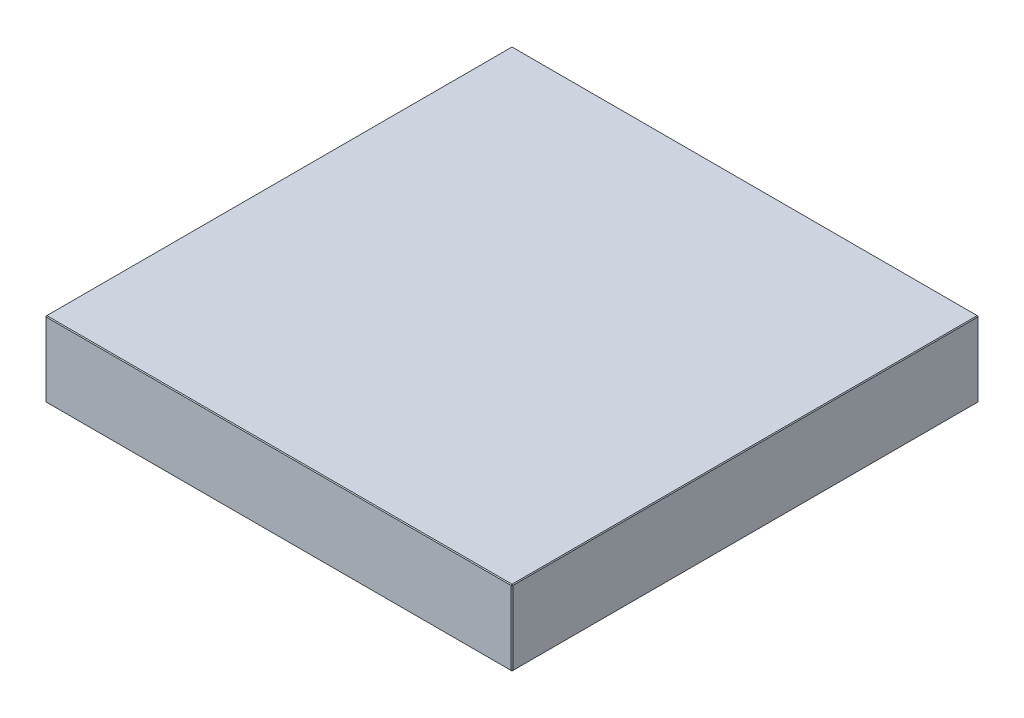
ISO-10303-21;
HEADER;
FILE_DESCRIPTION(('STEP AP214'),'2;1');
FILE_NAME('part.step','',(''),(''),'','','');
FILE_SCHEMA(('AUTOMOTIVE_DESIGN { 1 0 10303 214 1 1 1 1 }'));
ENDSEC;
DATA;
#1=APPLICATION_CONTEXT('core data for automotive mechanical design processes');
#2=APPLICATION_PROTOCOL_DEFINITION('international standard','automotive_design',2000,#1);
#3=PRODUCT_CONTEXT('',#1,'mechanical');
#4=PRODUCT('Part','Part','',(#3));
#5=PRODUCT_RELATED_PRODUCT_CATEGORY('part','',(#4));
#6=PRODUCT_DEFINITION_FORMATION('','',#4);
#7=PRODUCT_DEFINITION_CONTEXT('part definition',#1,'design');
#8=PRODUCT_DEFINITION('design','',#6,#7);
#9=PRODUCT_DEFINITION_SHAPE('','',#8);
#10=(LENGTH_UNIT() NAMED_UNIT(*) SI_UNIT(.MILLI.,.METRE.));
#11=(NAMED_UNIT(*) PLANE_ANGLE_UNIT() SI_UNIT($,.RADIAN.));
#12=(NAMED_UNIT(*) SI_UNIT($,.STERADIAN.) SOLID_ANGLE_UNIT());
#13=UNCERTAINTY_MEASURE_WITH_UNIT(LENGTH_MEASURE(1.E-05),#10,'distance_accuracy_value','');
#14=(GEOMETRIC_REPRESENTATION_CONTEXT(3) GLOBAL_UNCERTAINTY_ASSIGNED_CONTEXT((#13)) GLOBAL_UNIT_ASSIGNED_CONTEXT((#10,
#11,#12)) REPRESENTATION_CONTEXT('',''));
#15=CARTESIAN_POINT('',(0.,0.,0.));
#16=DIRECTION('',(0.,0.,1.));
#17=DIRECTION('',(1.,0.,0.));
#18=AXIS2_PLACEMENT_3D('',#15,#16,#17);
#19=CARTESIAN_POINT('',(-298.,96.,298.));
#20=DIRECTION('',(1.,0.,0.));
#21=DIRECTION('',(0.,0.,-1.));
#22=AXIS2_PLACEMENT_3D('',#19,#20,#21);
#23=PLANE('',#22);
#24=DIRECTION('',(0.,-1.,0.));
#25=VECTOR('',#24,1.);
#26=CARTESIAN_POINT('',(-298.,96.,-297.));
#27=LINE('',#26,#25);
#28=CARTESIAN_POINT('',(-298.,95.,-297.));
#29=VERTEX_POINT('',#28);
#30=CARTESIAN_POINT('',(-298.,1.,-297.));
#31=VERTEX_POINT('',#30);
#32=EDGE_CURVE('E115',#29,#31,#27,.T.);
#33=ORIENTED_EDGE('',*,*,#32,.T.);
#34=DIRECTION('',(0.,0.,1.));
#35=VECTOR('',#34,1.);
#36=CARTESIAN_POINT('',(-298.,1.,298.));
#37=LINE('',#36,#35);
#38=CARTESIAN_POINT('',(-298.,1.,297.));
#39=VERTEX_POINT('',#38);
#40=EDGE_CURVE('E111',#31,#39,#37,.T.);
#41=ORIENTED_EDGE('',*,*,#40,.T.);
#42=DIRECTION('',(0.,1.,0.));
#43=VECTOR('',#42,1.);
#44=CARTESIAN_POINT('',(-298.,96.,297.));
#45=LINE('',#44,#43);
#46=CARTESIAN_POINT('',(-298.,95.,297.));
#47=VERTEX_POINT('',#46);
#48=EDGE_CURVE('E104',#39,#47,#45,.T.);
#49=ORIENTED_EDGE('',*,*,#48,.T.);
#50=DIRECTION('',(0.,0.,-1.));
#51=VECTOR('',#50,1.);
#52=CARTESIAN_POINT('',(-298.,95.,-298.));
#53=LINE('',#52,#51);
#54=EDGE_CURVE('E108',#47,#29,#53,.T.);
#55=ORIENTED_EDGE('',*,*,#54,.T.);
#56=EDGE_LOOP('',(#33,#41,#49,#55));
#57=FACE_BOUND('',#56,.T.);
#58=ADVANCED_FACE('F16',(#57),#23,.F.);
#59=CARTESIAN_POINT('',(298.,96.,298.));
#60=DIRECTION('',(0.,0.,-1.));
#61=DIRECTION('',(-1.,0.,0.));
#62=AXIS2_PLACEMENT_3D('',#59,#60,#61);
#63=PLANE('',#62);
#64=DIRECTION('',(-1.,0.,0.));
#65=VECTOR('',#64,1.);
#66=CARTESIAN_POINT('',(-298.,95.,298.));
#67=LINE('',#66,#65);
#68=CARTESIAN_POINT('',(297.,95.,298.));
#69=VERTEX_POINT('',#68);
#70=CARTESIAN_POINT('',(-297.,95.,298.));
#71=VERTEX_POINT('',#70);
#72=EDGE_CURVE('E165',#69,#71,#67,.T.);
#73=ORIENTED_EDGE('',*,*,#72,.T.);
#74=DIRECTION('',(0.,-1.,0.));
#75=VECTOR('',#74,1.);
#76=CARTESIAN_POINT('',(-297.,96.,298.));
#77=LINE('',#76,#75);
#78=CARTESIAN_POINT('',(-297.,1.,298.));
#79=VERTEX_POINT('',#78);
#80=EDGE_CURVE('E123',#71,#79,#77,.T.);
#81=ORIENTED_EDGE('',*,*,#80,.T.);
#82=DIRECTION('',(1.,0.,0.));
#83=VECTOR('',#82,1.);
#84=CARTESIAN_POINT('',(298.,1.,298.));
#85=LINE('',#84,#83);
#86=CARTESIAN_POINT('',(297.,1.,298.));
#87=VERTEX_POINT('',#86);
#88=EDGE_CURVE('E169',#79,#87,#85,.T.);
#89=ORIENTED_EDGE('',*,*,#88,.T.);
#90=DIRECTION('',(0.,1.,0.));
#91=VECTOR('',#90,1.);
#92=CARTESIAN_POINT('',(297.,96.,298.));
#93=LINE('',#92,#91);
#94=EDGE_CURVE('E167',#87,#69,#93,.T.);
#95=ORIENTED_EDGE('',*,*,#94,.T.);
#96=EDGE_LOOP('',(#73,#81,#89,#95));
#97=FACE_BOUND('',#96,.T.);
#98=ADVANCED_FACE('F276',(#97),#63,.F.);
#99=CARTESIAN_POINT('',(298.,96.,298.));
#100=DIRECTION('',(-1.,0.,0.));
#101=DIRECTION('',(0.,0.,1.));
#102=AXIS2_PLACEMENT_3D('',#99,#100,#101);
#103=PLANE('',#102);
#104=DIRECTION('',(0.,0.,-1.));
#105=VECTOR('',#104,1.);
#106=CARTESIAN_POINT('',(298.,1.,298.));
#107=LINE('',#106,#105);
#108=CARTESIAN_POINT('',(298.,1.,297.));
#109=VERTEX_POINT('',#108);
#110=CARTESIAN_POINT('',(298.,1.,-297.));
#111=VERTEX_POINT('',#110);
#112=EDGE_CURVE('E160',#109,#111,#107,.T.);
#113=ORIENTED_EDGE('',*,*,#112,.T.);
#114=DIRECTION('',(0.,1.,0.));
#115=VECTOR('',#114,1.);
#116=CARTESIAN_POINT('',(298.,96.,-297.));
#117=LINE('',#116,#115);
#118=CARTESIAN_POINT('',(298.,95.,-297.));
#119=VERTEX_POINT('',#118);
#120=EDGE_CURVE('E162',#111,#119,#117,.T.);
#121=ORIENTED_EDGE('',*,*,#120,.T.);
#122=DIRECTION('',(0.,0.,1.));
#123=VECTOR('',#122,1.);
#124=CARTESIAN_POINT('',(298.,95.,298.));
#125=LINE('',#124,#123);
#126=CARTESIAN_POINT('',(298.,95.,297.));
#127=VERTEX_POINT('',#126);
#128=EDGE_CURVE('E156',#119,#127,#125,.T.);
#129=ORIENTED_EDGE('',*,*,#128,.T.);
#130=DIRECTION('',(0.,-1.,0.));
#131=VECTOR('',#130,1.);
#132=CARTESIAN_POINT('',(298.,96.,297.));
#133=LINE('',#132,#131);
#134=EDGE_CURVE('E158',#127,#109,#133,.T.);
#135=ORIENTED_EDGE('',*,*,#134,.T.);
#136=EDGE_LOOP('',(#113,#121,#129,#135));
#137=FACE_BOUND('',#136,.T.);
#138=ADVANCED_FACE('F255',(#137),#103,.F.);
#139=CARTESIAN_POINT('',(298.,96.,-298.));
#140=DIRECTION('',(0.,0.,1.));
#141=DIRECTION('',(1.,0.,0.));
#142=AXIS2_PLACEMENT_3D('',#139,#140,#141);
#143=PLANE('',#142);
#144=DIRECTION('',(0.,-1.,0.));
#145=VECTOR('',#144,1.);
#146=CARTESIAN_POINT('',(297.,96.,-298.));
#147=LINE('',#146,#145);
#148=CARTESIAN_POINT('',(297.,95.,-298.));
#149=VERTEX_POINT('',#148);
#150=CARTESIAN_POINT('',(297.,1.,-298.));
#151=VERTEX_POINT('',#150);
#152=EDGE_CURVE('E149',#149,#151,#147,.T.);
#153=ORIENTED_EDGE('',*,*,#152,.T.);
#154=DIRECTION('',(-1.,0.,0.));
#155=VECTOR('',#154,1.);
#156=CARTESIAN_POINT('',(298.,1.,-298.));
#157=LINE('',#156,#155);
#158=CARTESIAN_POINT('',(-297.,1.,-298.));
#159=VERTEX_POINT('',#158);
#160=EDGE_CURVE('E154',#151,#159,#157,.T.);
#161=ORIENTED_EDGE('',*,*,#160,.T.);
#162=DIRECTION('',(0.,1.,0.));
#163=VECTOR('',#162,1.);
#164=CARTESIAN_POINT('',(-297.,96.,-298.));
#165=LINE('',#164,#163);
#166=CARTESIAN_POINT('',(-297.,95.,-298.));
#167=VERTEX_POINT('',#166);
#168=EDGE_CURVE('E151',#159,#167,#165,.T.);
#169=ORIENTED_EDGE('',*,*,#168,.T.);
#170=DIRECTION('',(1.,0.,0.));
#171=VECTOR('',#170,1.);
#172=CARTESIAN_POINT('',(298.,95.,-298.));
#173=LINE('',#172,#171);
#174=EDGE_CURVE('E147',#167,#149,#173,.T.);
#175=ORIENTED_EDGE('',*,*,#174,.T.);
#176=EDGE_LOOP('',(#153,#161,#169,#175));
#177=FACE_BOUND('',#176,.T.);
#178=ADVANCED_FACE('F285',(#177),#143,.F.);
#179=CARTESIAN_POINT('',(0.,96.,0.));
#180=DIRECTION('',(0.,1.,0.));
#181=DIRECTION('',(0.,0.,1.));
#182=AXIS2_PLACEMENT_3D('',#179,#180,#181);
#183=PLANE('',#182);
#184=DIRECTION('',(0.,0.,-1.));
#185=VECTOR('',#184,1.);
#186=CARTESIAN_POINT('',(297.,96.,-298.));
#187=LINE('',#186,#185);
#188=CARTESIAN_POINT('',(297.,96.,297.));
#189=VERTEX_POINT('',#188);
#190=CARTESIAN_POINT('',(297.,96.,-297.));
#191=VERTEX_POINT('',#190);
#192=EDGE_CURVE('E25',#189,#191,#187,.T.);
#193=ORIENTED_EDGE('',*,*,#192,.T.);
#194=DIRECTION('',(-1.,0.,0.));
#195=VECTOR('',#194,1.);
#196=CARTESIAN_POINT('',(-298.,96.,-297.));
#197=LINE('',#196,#195);
#198=CARTESIAN_POINT('',(-297.,96.,-297.));
#199=VERTEX_POINT('',#198);
#200=EDGE_CURVE('E10',#191,#199,#197,.T.);
#201=ORIENTED_EDGE('',*,*,#200,.T.);
#202=DIRECTION('',(0.,0.,1.));
#203=VECTOR('',#202,1.);
#204=CARTESIAN_POINT('',(-297.,96.,298.));
#205=LINE('',#204,#203);
#206=CARTESIAN_POINT('',(-297.,96.,297.));
#207=VERTEX_POINT('',#206);
#208=EDGE_CURVE('E181',#199,#207,#205,.T.);
#209=ORIENTED_EDGE('',*,*,#208,.T.);
#210=DIRECTION('',(1.,0.,0.));
#211=VECTOR('',#210,1.);
#212=CARTESIAN_POINT('',(298.,96.,297.));
#213=LINE('',#212,#211);
#214=EDGE_CURVE('E36',#207,#189,#213,.T.);
#215=ORIENTED_EDGE('',*,*,#214,.T.);
#216=EDGE_LOOP('',(#193,#201,#209,#215));
#217=FACE_BOUND('',#216,.T.);
#218=ADVANCED_FACE('F351',(#217),#183,.T.);
#219=CARTESIAN_POINT('',(0.,0.,0.));
#220=DIRECTION('',(0.,1.,0.));
#221=DIRECTION('',(0.,0.,1.));
#222=AXIS2_PLACEMENT_3D('',#219,#220,#221);
#223=PLANE('',#222);
#224=DIRECTION('',(0.,0.,1.));
#225=VECTOR('',#224,1.);
#226=CARTESIAN_POINT('',(297.,0.,0.));
#227=LINE('',#226,#225);
#228=CARTESIAN_POINT('',(297.,0.,-297.));
#229=VERTEX_POINT('',#228);
#230=CARTESIAN_POINT('',(297.,0.,297.));
#231=VERTEX_POINT('',#230);
#232=EDGE_CURVE('E172',#229,#231,#227,.T.);
#233=ORIENTED_EDGE('',*,*,#232,.T.);
#234=DIRECTION('',(-1.,0.,0.));
#235=VECTOR('',#234,1.);
#236=CARTESIAN_POINT('',(0.,0.,297.));
#237=LINE('',#236,#235);
#238=CARTESIAN_POINT('',(-297.,0.,297.));
#239=VERTEX_POINT('',#238);
#240=EDGE_CURVE('E178',#231,#239,#237,.T.);
#241=ORIENTED_EDGE('',*,*,#240,.T.);
#242=DIRECTION('',(0.,0.,-1.));
#243=VECTOR('',#242,1.);
#244=CARTESIAN_POINT('',(-297.,0.,0.));
#245=LINE('',#244,#243);
#246=CARTESIAN_POINT('',(-297.,0.,-297.));
#247=VERTEX_POINT('',#246);
#248=EDGE_CURVE('E176',#239,#247,#245,.T.);
#249=ORIENTED_EDGE('',*,*,#248,.T.);
#250=DIRECTION('',(1.,0.,0.));
#251=VECTOR('',#250,1.);
#252=CARTESIAN_POINT('',(0.,0.,-297.));
#253=LINE('',#252,#251);
#254=EDGE_CURVE('E174',#247,#229,#253,.T.);
#255=ORIENTED_EDGE('',*,*,#254,.T.);
#256=EDGE_LOOP('',(#233,#241,#249,#255));
#257=FACE_BOUND('',#256,.T.);
#258=ADVANCED_FACE('F247',(#257),#223,.F.);
#259=CARTESIAN_POINT('',(298.,96.,297.));
#260=DIRECTION('',(-0.707106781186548,0.,-0.707106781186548));
#261=DIRECTION('',(0.,-1.,0.));
#262=AXIS2_PLACEMENT_3D('',#259,#260,#261);
#263=PLANE('',#262);
#264=DIRECTION('',(-0.707106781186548,0.,0.707106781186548));
#265=VECTOR('',#264,1.);
#266=CARTESIAN_POINT('',(297.,95.,298.));
#267=LINE('',#266,#265);
#268=EDGE_CURVE('E20',#69,#127,#267,.F.);
#269=ORIENTED_EDGE('',*,*,#268,.F.);
#270=ORIENTED_EDGE('',*,*,#94,.F.);
#271=DIRECTION('',(0.707106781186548,0.,-0.707106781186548));
#272=VECTOR('',#271,1.);
#273=CARTESIAN_POINT('',(297.,1.,298.));
#274=LINE('',#273,#272);
#275=EDGE_CURVE('E143',#109,#87,#274,.F.);
#276=ORIENTED_EDGE('',*,*,#275,.F.);
#277=ORIENTED_EDGE('',*,*,#134,.F.);
#278=EDGE_LOOP('',(#269,#270,#276,#277));
#279=FACE_BOUND('',#278,.T.);
#280=ADVANCED_FACE('F18',(#279),#263,.F.);
#281=CARTESIAN_POINT('',(297.,95.,298.));
#282=DIRECTION('',(0.577350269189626,0.577350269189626,0.577350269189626));
#283=DIRECTION('',(0.707106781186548,0.,-0.707106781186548));
#284=AXIS2_PLACEMENT_3D('',#281,#282,#283);
#285=PLANE('',#284);
#286=DIRECTION('',(0.,-0.707106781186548,0.707106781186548));
#287=VECTOR('',#286,1.);
#288=CARTESIAN_POINT('',(297.,95.,298.));
#289=LINE('',#288,#287);
#290=EDGE_CURVE('E227',#69,#189,#289,.F.);
#291=ORIENTED_EDGE('',*,*,#290,.F.);
#292=ORIENTED_EDGE('',*,*,#268,.T.);
#293=DIRECTION('',(-0.707106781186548,0.707106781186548,0.));
#294=VECTOR('',#293,1.);
#295=CARTESIAN_POINT('',(297.5,95.5,297.));
#296=LINE('',#295,#294);
#297=EDGE_CURVE('E229',#189,#127,#296,.F.);
#298=ORIENTED_EDGE('',*,*,#297,.F.);
#299=EDGE_LOOP('',(#291,#292,#298));
#300=FACE_BOUND('',#299,.T.);
#301=ADVANCED_FACE('F271',(#300),#285,.T.);
#302=CARTESIAN_POINT('',(297.,1.,298.));
#303=DIRECTION('',(0.577350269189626,-0.577350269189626,0.577350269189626));
#304=DIRECTION('',(0.707106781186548,0.,-0.707106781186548));
#305=AXIS2_PLACEMENT_3D('',#302,#303,#304);
#306=PLANE('',#305);
#307=DIRECTION('',(-0.707106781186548,-0.707106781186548,0.));
#308=VECTOR('',#307,1.);
#309=CARTESIAN_POINT('',(297.5,0.5,297.));
#310=LINE('',#309,#308);
#311=EDGE_CURVE('E221',#109,#231,#310,.T.);
#312=ORIENTED_EDGE('',*,*,#311,.F.);
#313=ORIENTED_EDGE('',*,*,#275,.T.);
#314=DIRECTION('',(0.,0.707106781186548,0.707106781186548));
#315=VECTOR('',#314,1.);
#316=CARTESIAN_POINT('',(297.,1.,298.));
#317=LINE('',#316,#315);
#318=EDGE_CURVE('E224',#231,#87,#317,.T.);
#319=ORIENTED_EDGE('',*,*,#318,.F.);
#320=EDGE_LOOP('',(#312,#313,#319));
#321=FACE_BOUND('',#320,.T.);
#322=ADVANCED_FACE('F236',(#321),#306,.T.);
#323=CARTESIAN_POINT('',(297.,96.,0.));
#324=DIRECTION('',(0.707106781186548,0.707106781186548,0.));
#325=DIRECTION('',(0.,0.,1.));
#326=AXIS2_PLACEMENT_3D('',#323,#324,#325);
#327=PLANE('',#326);
#328=ORIENTED_EDGE('',*,*,#297,.T.);
#329=ORIENTED_EDGE('',*,*,#128,.F.);
#330=DIRECTION('',(0.707106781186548,-0.707106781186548,0.));
#331=VECTOR('',#330,1.);
#332=CARTESIAN_POINT('',(298.,95.,-297.));
#333=LINE('',#332,#331);
#334=EDGE_CURVE('E216',#191,#119,#333,.T.);
#335=ORIENTED_EDGE('',*,*,#334,.F.);
#336=ORIENTED_EDGE('',*,*,#192,.F.);
#337=EDGE_LOOP('',(#328,#329,#335,#336));
#338=FACE_BOUND('',#337,.T.);
#339=ADVANCED_FACE('F266',(#338),#327,.T.);
#340=CARTESIAN_POINT('',(0.,96.,297.));
#341=DIRECTION('',(0.,0.707106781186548,0.707106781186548));
#342=DIRECTION('',(-1.,0.,0.));
#343=AXIS2_PLACEMENT_3D('',#340,#341,#342);
#344=PLANE('',#343);
#345=ORIENTED_EDGE('',*,*,#290,.T.);
#346=ORIENTED_EDGE('',*,*,#214,.F.);
#347=DIRECTION('',(0.,0.707106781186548,-0.707106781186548));
#348=VECTOR('',#347,1.);
#349=CARTESIAN_POINT('',(-297.,95.5,297.5));
#350=LINE('',#349,#348);
#351=EDGE_CURVE('E127',#71,#207,#350,.T.);
#352=ORIENTED_EDGE('',*,*,#351,.F.);
#353=ORIENTED_EDGE('',*,*,#72,.F.);
#354=EDGE_LOOP('',(#345,#346,#352,#353));
#355=FACE_BOUND('',#354,.T.);
#356=ADVANCED_FACE('F274',(#355),#344,.T.);
#357=CARTESIAN_POINT('',(-297.,96.,298.));
#358=DIRECTION('',(0.707106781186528,0.,-0.707106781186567));
#359=DIRECTION('',(0.,-1.,0.));
#360=AXIS2_PLACEMENT_3D('',#357,#358,#359);
#361=PLANE('',#360);
#362=DIRECTION('',(0.707106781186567,0.,0.707106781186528));
#363=VECTOR('',#362,1.);
#364=CARTESIAN_POINT('',(-297.,1.,298.));
#365=LINE('',#364,#363);
#366=EDGE_CURVE('E128',#79,#39,#365,.F.);
#367=ORIENTED_EDGE('',*,*,#366,.F.);
#368=ORIENTED_EDGE('',*,*,#80,.F.);
#369=DIRECTION('',(-0.707106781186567,0.,-0.707106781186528));
#370=VECTOR('',#369,1.);
#371=CARTESIAN_POINT('',(-298.,95.,297.));
#372=LINE('',#371,#370);
#373=EDGE_CURVE('E119',#47,#71,#372,.F.);
#374=ORIENTED_EDGE('',*,*,#373,.F.);
#375=ORIENTED_EDGE('',*,*,#48,.F.);
#376=EDGE_LOOP('',(#367,#368,#374,#375));
#377=FACE_BOUND('',#376,.T.);
#378=ADVANCED_FACE('F121',(#377),#361,.F.);
#379=CARTESIAN_POINT('',(298.,1.,298.));
#380=DIRECTION('',(0.,0.707106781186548,-0.707106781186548));
#381=DIRECTION('',(1.,0.,0.));
#382=AXIS2_PLACEMENT_3D('',#379,#380,#381);
#383=PLANE('',#382);
#384=ORIENTED_EDGE('',*,*,#318,.T.);
#385=ORIENTED_EDGE('',*,*,#88,.F.);
#386=DIRECTION('',(0.,-0.707106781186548,-0.707106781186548));
#387=VECTOR('',#386,1.);
#388=CARTESIAN_POINT('',(-297.,1.,298.));
#389=LINE('',#388,#387);
#390=EDGE_CURVE('E212',#239,#79,#389,.F.);
#391=ORIENTED_EDGE('',*,*,#390,.F.);
#392=ORIENTED_EDGE('',*,*,#240,.F.);
#393=EDGE_LOOP('',(#384,#385,#391,#392));
#394=FACE_BOUND('',#393,.T.);
#395=ADVANCED_FACE('F244',(#394),#383,.F.);
#396=CARTESIAN_POINT('',(298.,1.,298.));
#397=DIRECTION('',(-0.707106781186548,0.707106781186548,0.));
#398=DIRECTION('',(0.,0.,-1.));
#399=AXIS2_PLACEMENT_3D('',#396,#397,#398);
#400=PLANE('',#399);
#401=ORIENTED_EDGE('',*,*,#311,.T.);
#402=ORIENTED_EDGE('',*,*,#232,.F.);
#403=DIRECTION('',(0.707106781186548,0.707106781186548,0.));
#404=VECTOR('',#403,1.);
#405=CARTESIAN_POINT('',(297.5,0.5,-297.));
#406=LINE('',#405,#404);
#407=EDGE_CURVE('E209',#111,#229,#406,.F.);
#408=ORIENTED_EDGE('',*,*,#407,.F.);
#409=ORIENTED_EDGE('',*,*,#112,.F.);
#410=EDGE_LOOP('',(#401,#402,#408,#409));
#411=FACE_BOUND('',#410,.T.);
#412=ADVANCED_FACE('F252',(#411),#400,.F.);
#413=CARTESIAN_POINT('',(297.,96.,-298.));
#414=DIRECTION('',(-0.707106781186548,0.,0.707106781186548));
#415=DIRECTION('',(0.,-1.,0.));
#416=AXIS2_PLACEMENT_3D('',#413,#414,#415);
#417=PLANE('',#416);
#418=DIRECTION('',(0.707106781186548,0.,0.707106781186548));
#419=VECTOR('',#418,1.);
#420=CARTESIAN_POINT('',(298.,95.,-297.));
#421=LINE('',#420,#419);
#422=EDGE_CURVE('E218',#119,#149,#421,.F.);
#423=ORIENTED_EDGE('',*,*,#422,.F.);
#424=ORIENTED_EDGE('',*,*,#120,.F.);
#425=DIRECTION('',(-0.707106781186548,0.,-0.707106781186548));
#426=VECTOR('',#425,1.);
#427=CARTESIAN_POINT('',(297.,1.,-298.));
#428=LINE('',#427,#426);
#429=EDGE_CURVE('E206',#151,#111,#428,.F.);
#430=ORIENTED_EDGE('',*,*,#429,.F.);
#431=ORIENTED_EDGE('',*,*,#152,.F.);
#432=EDGE_LOOP('',(#423,#424,#430,#431));
#433=FACE_BOUND('',#432,.T.);
#434=ADVANCED_FACE('F259',(#433),#417,.F.);
#435=CARTESIAN_POINT('',(298.,95.,-297.));
#436=DIRECTION('',(0.577350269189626,0.577350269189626,-0.577350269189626));
#437=DIRECTION('',(-0.707106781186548,0.,-0.707106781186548));
#438=AXIS2_PLACEMENT_3D('',#435,#436,#437);
#439=PLANE('',#438);
#440=ORIENTED_EDGE('',*,*,#334,.T.);
#441=ORIENTED_EDGE('',*,*,#422,.T.);
#442=DIRECTION('',(0.,0.707106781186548,0.707106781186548));
#443=VECTOR('',#442,1.);
#444=CARTESIAN_POINT('',(297.,95.5,-297.5));
#445=LINE('',#444,#443);
#446=EDGE_CURVE('E135',#191,#149,#445,.F.);
#447=ORIENTED_EDGE('',*,*,#446,.F.);
#448=EDGE_LOOP('',(#440,#441,#447));
#449=FACE_BOUND('',#448,.T.);
#450=ADVANCED_FACE('F326',(#449),#439,.T.);
#451=CARTESIAN_POINT('',(-298.,95.,297.));
#452=DIRECTION('',(-0.577350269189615,0.577350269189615,0.577350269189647));
#453=DIRECTION('',(0.707106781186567,0.,0.707106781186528));
#454=AXIS2_PLACEMENT_3D('',#451,#452,#453);
#455=PLANE('',#454);
#456=ORIENTED_EDGE('',*,*,#373,.T.);
#457=ORIENTED_EDGE('',*,*,#351,.T.);
#458=DIRECTION('',(-0.707106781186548,-0.707106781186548,0.));
#459=VECTOR('',#458,1.);
#460=CARTESIAN_POINT('',(-298.,95.,297.));
#461=LINE('',#460,#459);
#462=EDGE_CURVE('E131',#47,#207,#461,.F.);
#463=ORIENTED_EDGE('',*,*,#462,.F.);
#464=EDGE_LOOP('',(#456,#457,#463));
#465=FACE_BOUND('',#464,.T.);
#466=ADVANCED_FACE('F132',(#465),#455,.T.);
#467=CARTESIAN_POINT('',(-297.,1.,298.));
#468=DIRECTION('',(-0.577350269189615,-0.577350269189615,0.577350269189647));
#469=DIRECTION('',(0.707106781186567,0.,0.707106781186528));
#470=AXIS2_PLACEMENT_3D('',#467,#468,#469);
#471=PLANE('',#470);
#472=ORIENTED_EDGE('',*,*,#390,.T.);
#473=ORIENTED_EDGE('',*,*,#366,.T.);
#474=DIRECTION('',(-0.707106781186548,0.707106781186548,0.));
#475=VECTOR('',#474,1.);
#476=CARTESIAN_POINT('',(-297.5,0.499999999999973,297.));
#477=LINE('',#476,#475);
#478=EDGE_CURVE('E136',#239,#39,#477,.T.);
#479=ORIENTED_EDGE('',*,*,#478,.F.);
#480=EDGE_LOOP('',(#472,#473,#479));
#481=FACE_BOUND('',#480,.T.);
#482=ADVANCED_FACE('F319',(#481),#471,.T.);
#483=CARTESIAN_POINT('',(297.,1.,-298.));
#484=DIRECTION('',(0.577350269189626,-0.577350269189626,-0.577350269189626));
#485=DIRECTION('',(-0.707106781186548,0.,-0.707106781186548));
#486=AXIS2_PLACEMENT_3D('',#483,#484,#485);
#487=PLANE('',#486);
#488=ORIENTED_EDGE('',*,*,#429,.T.);
#489=ORIENTED_EDGE('',*,*,#407,.T.);
#490=DIRECTION('',(0.,-0.707106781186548,0.707106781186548));
#491=VECTOR('',#490,1.);
#492=CARTESIAN_POINT('',(297.,1.,-298.));
#493=LINE('',#492,#491);
#494=EDGE_CURVE('E199',#151,#229,#493,.T.);
#495=ORIENTED_EDGE('',*,*,#494,.F.);
#496=EDGE_LOOP('',(#488,#489,#495));
#497=FACE_BOUND('',#496,.T.);
#498=ADVANCED_FACE('F315',(#497),#487,.T.);
#499=CARTESIAN_POINT('',(0.,96.,-297.));
#500=DIRECTION('',(0.,0.707106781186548,-0.707106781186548));
#501=DIRECTION('',(1.,0.,0.));
#502=AXIS2_PLACEMENT_3D('',#499,#500,#501);
#503=PLANE('',#502);
#504=ORIENTED_EDGE('',*,*,#446,.T.);
#505=ORIENTED_EDGE('',*,*,#174,.F.);
#506=DIRECTION('',(0.,-0.707106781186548,-0.707106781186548));
#507=VECTOR('',#506,1.);
#508=CARTESIAN_POINT('',(-297.,95.,-298.));
#509=LINE('',#508,#507);
#510=EDGE_CURVE('E196',#199,#167,#509,.T.);
#511=ORIENTED_EDGE('',*,*,#510,.F.);
#512=ORIENTED_EDGE('',*,*,#200,.F.);
#513=EDGE_LOOP('',(#504,#505,#511,#512));
#514=FACE_BOUND('',#513,.T.);
#515=ADVANCED_FACE('F312',(#514),#503,.T.);
#516=CARTESIAN_POINT('',(-297.,96.,0.));
#517=DIRECTION('',(-0.707106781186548,0.707106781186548,0.));
#518=DIRECTION('',(0.,0.,-1.));
#519=AXIS2_PLACEMENT_3D('',#516,#517,#518);
#520=PLANE('',#519);
#521=ORIENTED_EDGE('',*,*,#462,.T.);
#522=ORIENTED_EDGE('',*,*,#208,.F.);
#523=DIRECTION('',(0.707106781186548,0.707106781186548,0.));
#524=VECTOR('',#523,1.);
#525=CARTESIAN_POINT('',(-297.5,95.5,-297.));
#526=LINE('',#525,#524);
#527=EDGE_CURVE('E139',#29,#199,#526,.T.);
#528=ORIENTED_EDGE('',*,*,#527,.F.);
#529=ORIENTED_EDGE('',*,*,#54,.F.);
#530=EDGE_LOOP('',(#521,#522,#528,#529));
#531=FACE_BOUND('',#530,.T.);
#532=ADVANCED_FACE('F138',(#531),#520,.T.);
#533=CARTESIAN_POINT('',(-298.,1.,298.));
#534=DIRECTION('',(0.707106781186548,0.707106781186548,0.));
#535=DIRECTION('',(0.,0.,1.));
#536=AXIS2_PLACEMENT_3D('',#533,#534,#535);
#537=PLANE('',#536);
#538=ORIENTED_EDGE('',*,*,#478,.T.);
#539=ORIENTED_EDGE('',*,*,#40,.F.);
#540=DIRECTION('',(0.707106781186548,-0.707106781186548,0.));
#541=VECTOR('',#540,1.);
#542=CARTESIAN_POINT('',(-298.,1.,-297.));
#543=LINE('',#542,#541);
#544=EDGE_CURVE('E192',#247,#31,#543,.F.);
#545=ORIENTED_EDGE('',*,*,#544,.F.);
#546=ORIENTED_EDGE('',*,*,#248,.F.);
#547=EDGE_LOOP('',(#538,#539,#545,#546));
#548=FACE_BOUND('',#547,.T.);
#549=ADVANCED_FACE('F305',(#548),#537,.F.);
#550=CARTESIAN_POINT('',(298.,1.,-298.));
#551=DIRECTION('',(0.,0.707106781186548,0.707106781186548));
#552=DIRECTION('',(-1.,0.,0.));
#553=AXIS2_PLACEMENT_3D('',#550,#551,#552);
#554=PLANE('',#553);
#555=ORIENTED_EDGE('',*,*,#494,.T.);
#556=ORIENTED_EDGE('',*,*,#254,.F.);
#557=DIRECTION('',(0.,0.707106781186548,-0.707106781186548));
#558=VECTOR('',#557,1.);
#559=CARTESIAN_POINT('',(-297.,0.499999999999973,-297.5));
#560=LINE('',#559,#558);
#561=EDGE_CURVE('E189',#159,#247,#560,.F.);
#562=ORIENTED_EDGE('',*,*,#561,.F.);
#563=ORIENTED_EDGE('',*,*,#160,.F.);
#564=EDGE_LOOP('',(#555,#556,#562,#563));
#565=FACE_BOUND('',#564,.T.);
#566=ADVANCED_FACE('F301',(#565),#554,.F.);
#567=CARTESIAN_POINT('',(-297.,95.,-298.));
#568=DIRECTION('',(-0.577350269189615,0.577350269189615,-0.577350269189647));
#569=DIRECTION('',(-0.707106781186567,0.,0.707106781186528));
#570=AXIS2_PLACEMENT_3D('',#567,#568,#569);
#571=PLANE('',#570);
#572=ORIENTED_EDGE('',*,*,#527,.T.);
#573=ORIENTED_EDGE('',*,*,#510,.T.);
#574=DIRECTION('',(0.707106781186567,0.,-0.707106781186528));
#575=VECTOR('',#574,1.);
#576=CARTESIAN_POINT('',(-297.,95.,-298.));
#577=LINE('',#576,#575);
#578=EDGE_CURVE('E187',#29,#167,#577,.T.);
#579=ORIENTED_EDGE('',*,*,#578,.F.);
#580=EDGE_LOOP('',(#572,#573,#579));
#581=FACE_BOUND('',#580,.T.);
#582=ADVANCED_FACE('F297',(#581),#571,.T.);
#583=CARTESIAN_POINT('',(-298.,1.,-297.));
#584=DIRECTION('',(-0.577350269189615,-0.577350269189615,-0.577350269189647));
#585=DIRECTION('',(-0.707106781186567,0.,0.707106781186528));
#586=AXIS2_PLACEMENT_3D('',#583,#584,#585);
#587=PLANE('',#586);
#588=ORIENTED_EDGE('',*,*,#561,.T.);
#589=ORIENTED_EDGE('',*,*,#544,.T.);
#590=DIRECTION('',(-0.707106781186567,0.,0.707106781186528));
#591=VECTOR('',#590,1.);
#592=CARTESIAN_POINT('',(-298.,1.,-297.));
#593=LINE('',#592,#591);
#594=EDGE_CURVE('E185',#159,#31,#593,.T.);
#595=ORIENTED_EDGE('',*,*,#594,.F.);
#596=EDGE_LOOP('',(#588,#589,#595));
#597=FACE_BOUND('',#596,.T.);
#598=ADVANCED_FACE('F293',(#597),#587,.T.);
#599=CARTESIAN_POINT('',(-298.,96.,-297.));
#600=DIRECTION('',(0.707106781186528,0.,0.707106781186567));
#601=DIRECTION('',(0.,-1.,0.));
#602=AXIS2_PLACEMENT_3D('',#599,#600,#601);
#603=PLANE('',#602);
#604=ORIENTED_EDGE('',*,*,#578,.T.);
#605=ORIENTED_EDGE('',*,*,#168,.F.);
#606=ORIENTED_EDGE('',*,*,#594,.T.);
#607=ORIENTED_EDGE('',*,*,#32,.F.);
#608=EDGE_LOOP('',(#604,#605,#606,#607));
#609=FACE_BOUND('',#608,.T.);
#610=ADVANCED_FACE('F290',(#609),#603,.F.);
#611=CLOSED_SHELL('',(#58,#98,#138,#178,#218,#258,#280,#301,#322,#339,#356,#378,#395,#412,#434,
#450,#466,#482,#498,#515,#532,#549,#566,#582,#598,#610));
#612=MANIFOLD_SOLID_BREP('B1',#611);
#613=ADVANCED_BREP_SHAPE_REPRESENTATION('',(#18,#612),#14);
#614=SHAPE_DEFINITION_REPRESENTATION(#9,#613);
ENDSEC;
END-ISO-10303-21;
